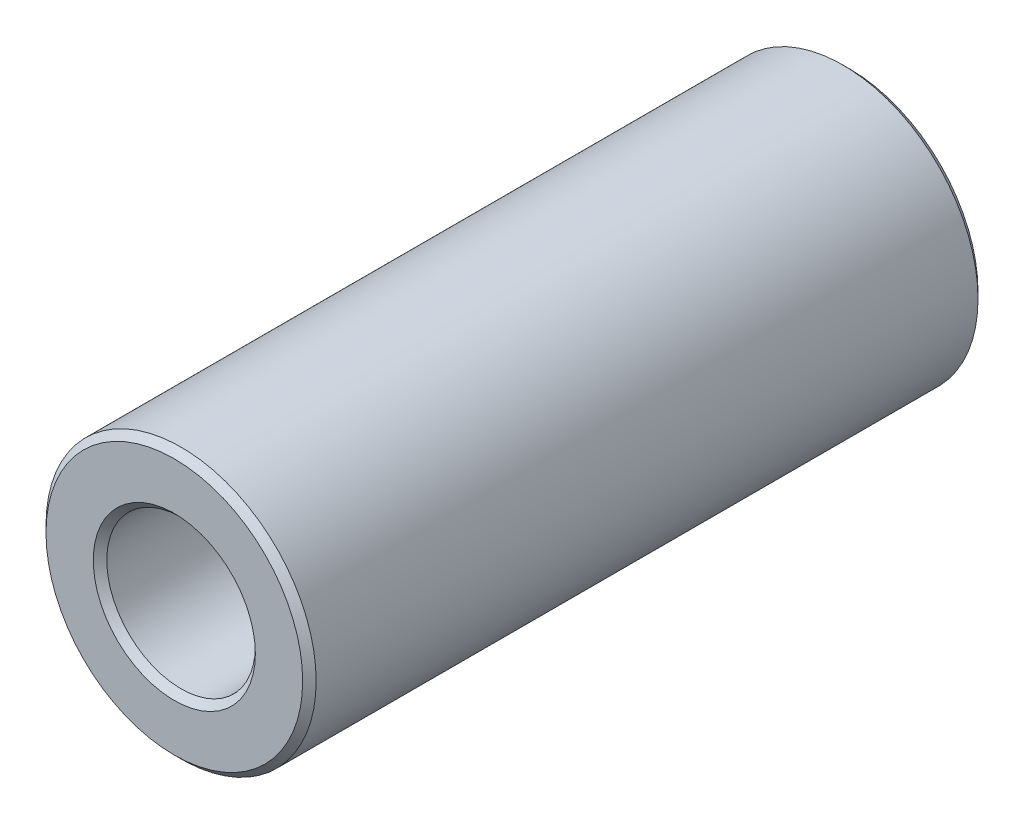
ISO-10303-21;
HEADER;
FILE_DESCRIPTION(('STEP AP214'),'2;1');
FILE_NAME('part.step','',(''),(''),'','','');
FILE_SCHEMA(('AUTOMOTIVE_DESIGN { 1 0 10303 214 1 1 1 1 }'));
ENDSEC;
DATA;
#1=APPLICATION_CONTEXT('core data for automotive mechanical design processes');
#2=APPLICATION_PROTOCOL_DEFINITION('international standard','automotive_design',2000,#1);
#3=PRODUCT_CONTEXT('',#1,'mechanical');
#4=PRODUCT('Part','Part','',(#3));
#5=PRODUCT_RELATED_PRODUCT_CATEGORY('part','',(#4));
#6=PRODUCT_DEFINITION_FORMATION('','',#4);
#7=PRODUCT_DEFINITION_CONTEXT('part definition',#1,'design');
#8=PRODUCT_DEFINITION('design','',#6,#7);
#9=PRODUCT_DEFINITION_SHAPE('','',#8);
#10=(LENGTH_UNIT() NAMED_UNIT(*) SI_UNIT(.MILLI.,.METRE.));
#11=(NAMED_UNIT(*) PLANE_ANGLE_UNIT() SI_UNIT($,.RADIAN.));
#12=(NAMED_UNIT(*) SI_UNIT($,.STERADIAN.) SOLID_ANGLE_UNIT());
#13=UNCERTAINTY_MEASURE_WITH_UNIT(LENGTH_MEASURE(1.E-05),#10,'distance_accuracy_value','');
#14=(GEOMETRIC_REPRESENTATION_CONTEXT(3) GLOBAL_UNCERTAINTY_ASSIGNED_CONTEXT((#13)) GLOBAL_UNIT_ASSIGNED_CONTEXT((#10,
#11,#12)) REPRESENTATION_CONTEXT('',''));
#15=CARTESIAN_POINT('',(0.,0.,0.));
#16=DIRECTION('',(0.,0.,1.));
#17=DIRECTION('',(1.,0.,0.));
#18=AXIS2_PLACEMENT_3D('',#15,#16,#17);
#19=CARTESIAN_POINT('',(0.,0.,5.));
#20=DIRECTION('',(0.,0.,1.));
#21=DIRECTION('',(1.,0.,0.));
#22=AXIS2_PLACEMENT_3D('',#19,#20,#21);
#23=PLANE('',#22);
#24=CARTESIAN_POINT('',(0.,0.,5.));
#25=DIRECTION('',(0.,0.,1.));
#26=DIRECTION('',(1.,0.,0.));
#27=AXIS2_PLACEMENT_3D('',#24,#25,#26);
#28=CIRCLE('',#27,1.2);
#29=CARTESIAN_POINT('',(1.2,0.,5.));
#30=VERTEX_POINT('',#29);
#31=EDGE_CURVE('E10',#30,#30,#28,.F.);
#32=ORIENTED_EDGE('',*,*,#31,.T.);
#33=EDGE_LOOP('',(#32));
#34=FACE_BOUND('',#33,.T.);
#35=CARTESIAN_POINT('',(0.,0.,5.));
#36=DIRECTION('',(0.,0.,1.));
#37=DIRECTION('',(1.,0.,0.));
#38=AXIS2_PLACEMENT_3D('',#35,#36,#37);
#39=CIRCLE('',#38,1.9);
#40=CARTESIAN_POINT('',(1.9,0.,5.));
#41=VERTEX_POINT('',#40);
#42=EDGE_CURVE('E45',#41,#41,#39,.T.);
#43=ORIENTED_EDGE('',*,*,#42,.T.);
#44=EDGE_LOOP('',(#43));
#45=FACE_BOUND('',#44,.T.);
#46=ADVANCED_FACE('F37',(#34,#45),#23,.T.);
#47=CARTESIAN_POINT('',(0.,0.,-5.));
#48=DIRECTION('',(0.,0.,1.));
#49=DIRECTION('',(1.,0.,0.));
#50=AXIS2_PLACEMENT_3D('',#47,#48,#49);
#51=PLANE('',#50);
#52=CARTESIAN_POINT('',(0.,0.,-5.));
#53=DIRECTION('',(0.,0.,1.));
#54=DIRECTION('',(1.,0.,0.));
#55=AXIS2_PLACEMENT_3D('',#52,#53,#54);
#56=CIRCLE('',#55,1.9);
#57=CARTESIAN_POINT('',(1.9,0.,-5.));
#58=VERTEX_POINT('',#57);
#59=EDGE_CURVE('E62',#58,#58,#56,.F.);
#60=ORIENTED_EDGE('',*,*,#59,.T.);
#61=EDGE_LOOP('',(#60));
#62=FACE_BOUND('',#61,.T.);
#63=CARTESIAN_POINT('',(0.,0.,-5.));
#64=DIRECTION('',(0.,0.,1.));
#65=DIRECTION('',(1.,0.,0.));
#66=AXIS2_PLACEMENT_3D('',#63,#64,#65);
#67=CIRCLE('',#66,1.2);
#68=CARTESIAN_POINT('',(1.2,0.,-5.));
#69=VERTEX_POINT('',#68);
#70=EDGE_CURVE('E66',#69,#69,#67,.T.);
#71=ORIENTED_EDGE('',*,*,#70,.T.);
#72=EDGE_LOOP('',(#71));
#73=FACE_BOUND('',#72,.T.);
#74=ADVANCED_FACE('F89',(#62,#73),#51,.F.);
#75=CARTESIAN_POINT('',(0.,0.,5.));
#76=DIRECTION('',(0.,0.,-1.));
#77=DIRECTION('',(-1.,0.,0.));
#78=AXIS2_PLACEMENT_3D('',#75,#76,#77);
#79=CYLINDRICAL_SURFACE('',#78,2.);
#80=CARTESIAN_POINT('',(0.,0.,-4.9));
#81=DIRECTION('',(0.,0.,1.));
#82=DIRECTION('',(1.,0.,0.));
#83=AXIS2_PLACEMENT_3D('',#80,#81,#82);
#84=CIRCLE('',#83,2.);
#85=CARTESIAN_POINT('',(2.,0.,-4.9));
#86=VERTEX_POINT('',#85);
#87=EDGE_CURVE('E70',#86,#86,#84,.T.);
#88=ORIENTED_EDGE('',*,*,#87,.T.);
#89=EDGE_LOOP('',(#88));
#90=FACE_BOUND('',#89,.T.);
#91=CARTESIAN_POINT('',(0.,0.,4.9));
#92=DIRECTION('',(0.,0.,1.));
#93=DIRECTION('',(1.,0.,0.));
#94=AXIS2_PLACEMENT_3D('',#91,#92,#93);
#95=CIRCLE('',#94,2.);
#96=CARTESIAN_POINT('',(2.,0.,4.9));
#97=VERTEX_POINT('',#96);
#98=EDGE_CURVE('E73',#97,#97,#95,.F.);
#99=ORIENTED_EDGE('',*,*,#98,.T.);
#100=EDGE_LOOP('',(#99));
#101=FACE_BOUND('',#100,.T.);
#102=ADVANCED_FACE('F78',(#90,#101),#79,.T.);
#103=CARTESIAN_POINT('',(0.,0.,5.));
#104=DIRECTION('',(0.,0.,-1.));
#105=DIRECTION('',(-1.,0.,0.));
#106=AXIS2_PLACEMENT_3D('',#103,#104,#105);
#107=CYLINDRICAL_SURFACE('',#106,1.1);
#108=CARTESIAN_POINT('',(0.,0.,-4.9));
#109=DIRECTION('',(0.,0.,1.));
#110=DIRECTION('',(1.,0.,0.));
#111=AXIS2_PLACEMENT_3D('',#108,#109,#110);
#112=CIRCLE('',#111,1.1);
#113=CARTESIAN_POINT('',(1.1,0.,-4.9));
#114=VERTEX_POINT('',#113);
#115=EDGE_CURVE('E52',#114,#114,#112,.F.);
#116=ORIENTED_EDGE('',*,*,#115,.T.);
#117=EDGE_LOOP('',(#116));
#118=FACE_BOUND('',#117,.T.);
#119=CARTESIAN_POINT('',(0.,0.,4.9));
#120=DIRECTION('',(0.,0.,1.));
#121=DIRECTION('',(1.,0.,0.));
#122=AXIS2_PLACEMENT_3D('',#119,#120,#121);
#123=CIRCLE('',#122,1.1);
#124=CARTESIAN_POINT('',(1.1,0.,4.9));
#125=VERTEX_POINT('',#124);
#126=EDGE_CURVE('E57',#125,#125,#123,.T.);
#127=ORIENTED_EDGE('',*,*,#126,.T.);
#128=EDGE_LOOP('',(#127));
#129=FACE_BOUND('',#128,.T.);
#130=ADVANCED_FACE('F97',(#118,#129),#107,.F.);
#131=CARTESIAN_POINT('',(0.,0.,-4.9));
#132=DIRECTION('',(0.,0.,1.));
#133=DIRECTION('',(1.,0.,0.));
#134=AXIS2_PLACEMENT_3D('',#131,#132,#133);
#135=CONICAL_SURFACE('',#134,2.,0.785398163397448);
#136=ORIENTED_EDGE('',*,*,#59,.F.);
#137=EDGE_LOOP('',(#136));
#138=FACE_BOUND('',#137,.T.);
#139=ORIENTED_EDGE('',*,*,#87,.F.);
#140=EDGE_LOOP('',(#139));
#141=FACE_BOUND('',#140,.T.);
#142=ADVANCED_FACE('F102',(#138,#141),#135,.T.);
#143=CARTESIAN_POINT('',(0.,0.,-5.));
#144=DIRECTION('',(0.,0.,-1.));
#145=DIRECTION('',(-1.,0.,0.));
#146=AXIS2_PLACEMENT_3D('',#143,#144,#145);
#147=CONICAL_SURFACE('',#146,1.2,0.785398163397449);
#148=ORIENTED_EDGE('',*,*,#115,.F.);
#149=EDGE_LOOP('',(#148));
#150=FACE_BOUND('',#149,.T.);
#151=ORIENTED_EDGE('',*,*,#70,.F.);
#152=EDGE_LOOP('',(#151));
#153=FACE_BOUND('',#152,.T.);
#154=ADVANCED_FACE('F86',(#150,#153),#147,.F.);
#155=CARTESIAN_POINT('',(0.,0.,4.9));
#156=DIRECTION('',(0.,0.,1.));
#157=DIRECTION('',(1.,0.,0.));
#158=AXIS2_PLACEMENT_3D('',#155,#156,#157);
#159=CONICAL_SURFACE('',#158,1.1,0.785398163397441);
#160=ORIENTED_EDGE('',*,*,#31,.F.);
#161=EDGE_LOOP('',(#160));
#162=FACE_BOUND('',#161,.T.);
#163=ORIENTED_EDGE('',*,*,#126,.F.);
#164=EDGE_LOOP('',(#163));
#165=FACE_BOUND('',#164,.T.);
#166=ADVANCED_FACE('F82',(#162,#165),#159,.F.);
#167=CARTESIAN_POINT('',(0.,0.,5.));
#168=DIRECTION('',(0.,0.,-1.));
#169=DIRECTION('',(-1.,0.,0.));
#170=AXIS2_PLACEMENT_3D('',#167,#168,#169);
#171=CONICAL_SURFACE('',#170,1.9,0.785398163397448);
#172=ORIENTED_EDGE('',*,*,#98,.F.);
#173=EDGE_LOOP('',(#172));
#174=FACE_BOUND('',#173,.T.);
#175=ORIENTED_EDGE('',*,*,#42,.F.);
#176=EDGE_LOOP('',(#175));
#177=FACE_BOUND('',#176,.T.);
#178=ADVANCED_FACE('F39',(#174,#177),#171,.T.);
#179=CLOSED_SHELL('',(#46,#74,#102,#130,#142,#154,#166,#178));
#180=MANIFOLD_SOLID_BREP('B2',#179);
#181=ADVANCED_BREP_SHAPE_REPRESENTATION('',(#18,#180),#14);
#182=SHAPE_DEFINITION_REPRESENTATION(#9,#181);
ENDSEC;
END-ISO-10303-21;
